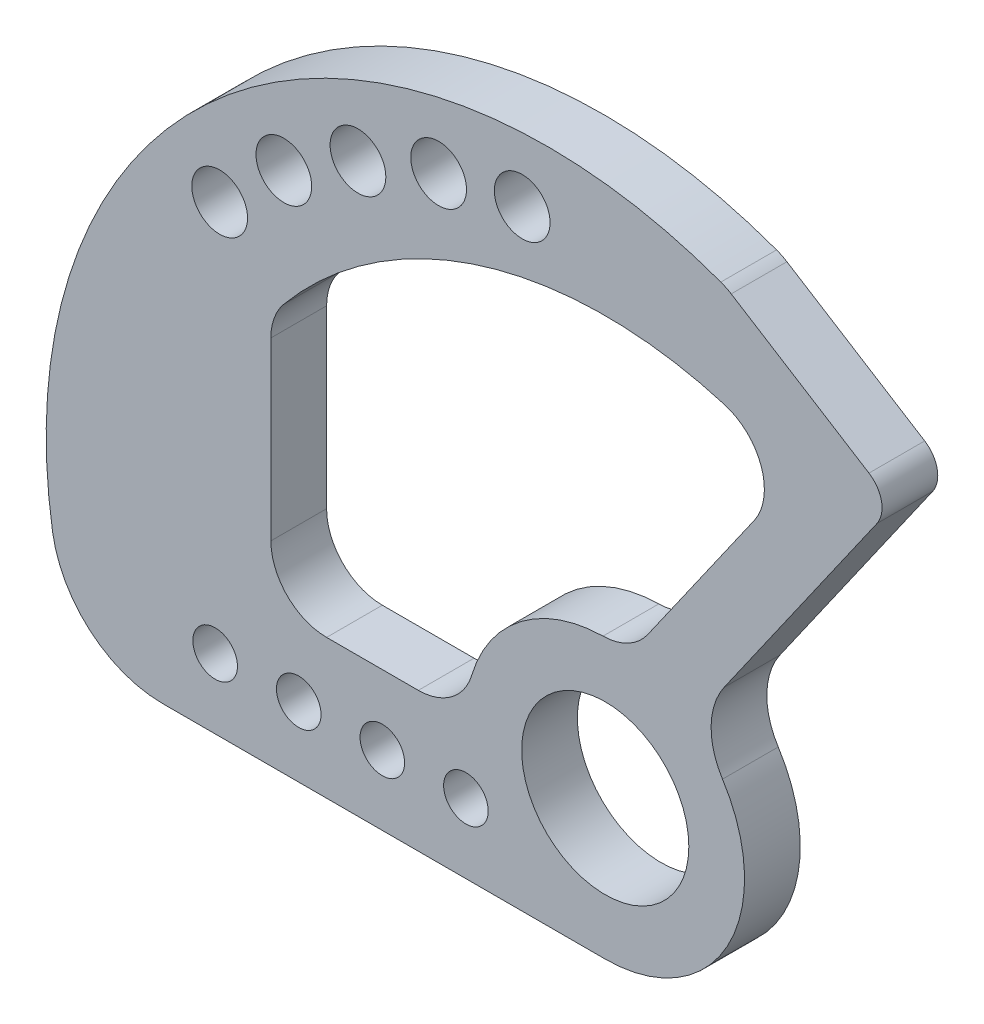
from build123d import *

# Parameters (mm, degrees)
ESQUISSE1_R        = 4
ESQUISSE1_R_2      = 15
ESQUISSE1_R_3      = 5
BOSS_EXTRU_1_DEPTH = 10


with BuildPart() as part:
    # Esquisse1 → Boss.-Extru.1 (new body)
    with BuildSketch(Plane.XY):
        with BuildLine():
            Line((-79.430413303, -25), (0, -25))
            ThreePointArc((0, -25), (21.935910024, -11.992324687), (21.045004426, 13.494731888))
            ThreePointArc((21.045004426, 13.494731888), (18.998654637, 20.749585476), (21.338346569, 27.915218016))
            Line((21.338346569, 27.915218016), (48.76789182, 67.088668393))
            ThreePointArc((48.76789182, 67.088668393), (49.572311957, 70.950649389), (47.326469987, 74.193824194))
            Line((47.326469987, 74.193824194), (22.603060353, 89.681210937))
            ThreePointArc((22.603060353, 89.681210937), (21.698225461, 90.184757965), (20.746168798, 90.592034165))
            ThreePointArc((20.746168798, 90.592034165), (-67.537201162, 75.594414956), (-99.176274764, -8.178199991))
            ThreePointArc((-99.176274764, -8.178199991), (-92.40030151, -20.224388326), (-79.430413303, -25))
        make_face()
        with Locations((-70, -12.5)):
            Circle(ESQUISSE1_R, mode=Mode.SUBTRACT)
        with Locations((-55, -12.5)):
            Circle(ESQUISSE1_R, mode=Mode.SUBTRACT)
        with Locations((-40, -12.5)):
            Circle(ESQUISSE1_R, mode=Mode.SUBTRACT)
        with Locations((-25, -12.5)):
            Circle(ESQUISSE1_R, mode=Mode.SUBTRACT)
        Circle(ESQUISSE1_R_2, mode=Mode.SUBTRACT)
        with Locations((-69.187373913, 58.055099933)):
            Circle(ESQUISSE1_R_3, mode=Mode.SUBTRACT)
        with Locations((-57.673548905, 68.732659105)):
            Circle(ESQUISSE1_R_3, mode=Mode.SUBTRACT)
        with Locations((-44.371521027, 76.853728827)):
            Circle(ESQUISSE1_R_3, mode=Mode.SUBTRACT)
        with Locations((-29.897671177, 82.143176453)):
            Circle(ESQUISSE1_R_3, mode=Mode.SUBTRACT)
        with BuildLine():
            ThreePointArc((-23.957871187, 7.142857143), (-27.564876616, 1.982162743), (-33.541019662, 0))
            Line((-33.541019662, 0), (-50, 0))
            ThreePointArc((-50, 0), (-57.071067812, 2.928932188), (-60, 10))
            Line((-60, 10), (-60, 41.533119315))
            ThreePointArc((-60, 41.533119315), (-59.405399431, 44.929950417), (-57.692307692, 47.922829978))
            ThreePointArc((-57.692307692, 47.922829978), (-21.739264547, 71.780250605), (21.409176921, 71.879393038))
            ThreePointArc((21.409176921, 71.879393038), (27.997984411, 65.585286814), (26.746140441, 56.559709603))
            Line((26.746140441, 56.559709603), (7.630495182, 29.259738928))
            ThreePointArc((7.630495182, 29.259738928), (4.127405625, 26.162688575), (-0.400732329, 24.996788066))
            ThreePointArc((-0.400732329, 24.996788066), (-15.100533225, 19.924203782), (-23.957871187, 7.142857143))
        make_face(mode=Mode.SUBTRACT)
        with Locations((-14.897883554, 84.490096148)):
            Circle(ESQUISSE1_R_3, mode=Mode.SUBTRACT)
    extrude(amount=BOSS_EXTRU_1_DEPTH)


solid = part.part
